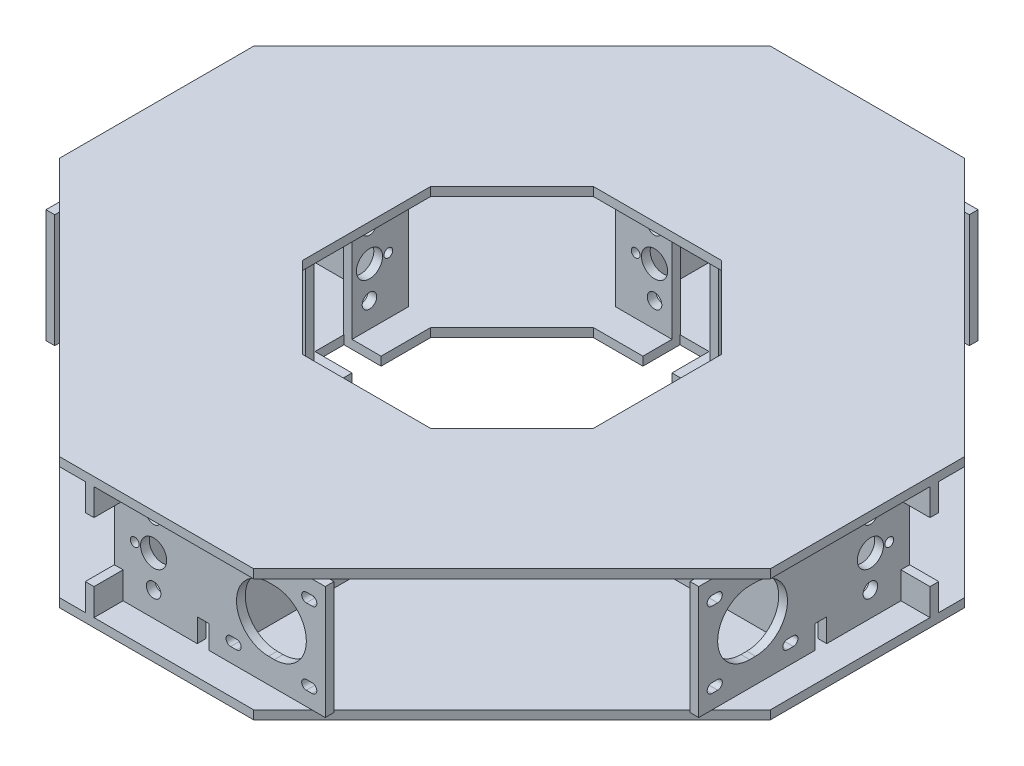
from build123d import *

# Parameters (mm, degrees)
EXTRUDE_1_DEPTH                      = 3
EXTRUDE_START                        = -21.5
SKETCH_2_W                           = 62.2
SKETCH_2_H                           = 75
EXTRUDE_2_DEPTH                      = 3
EXTRUDE_START_2                      = 8
SKETCH_2_2_W                         = 62.2
SKETCH_2_2_H                         = 75
EXTRUDE_3_DEPTH                      = 3
EXTRUDE_4_REACH                      = 190.39
EXTRUDE_4_DIRECTION_2_REACH          = 190.39
EXTRUDE_5_DEPTH                      = 16.5
SKETCH_5_R                           = 4.5
SKETCH_5_R_2                         = 2.5
SKETCH_5_R_3                         = 1.5
CUT_EXTRUDE_1_DEPTH                  = 275.774816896
EXTRUDE_10_DEPTH                     = 3
SKETCH_15_W                          = 6.950303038
SKETCH_15_H                          = 20.520259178
CUT_EXTRUDE_5_DEPTH                  = 10
PATTERN_CIRCULAR_3_COUNT             = 2
PATTERN_CIRCULAR_3_ANGLE             = 90
PATTERN_START                        = -21.5
PATTERN_CIRCULAR_3_COPY_1_SKETCH_W   = 62.2
PATTERN_CIRCULAR_3_COPY_1_SKETCH_H   = 75
PATTERN_CIRCULAR_3_COPY_1_DEPTH      = 3
PATTERN_START_2                      = 8
PATTERN_CIRCULAR_3_COPY_2_SKETCH_W   = 62.2
PATTERN_CIRCULAR_3_COPY_2_SKETCH_H   = 75
PATTERN_CIRCULAR_3_COPY_2_DEPTH      = 3
PATTERN_CIRCULAR_3_COPY_3_REACH      = 190.39
PATTERN_CIRCULAR_3_COPY_4_REACH      = 190.39
PATTERN_CIRCULAR_3_COPY_5_DEPTH      = 16.5
PATTERN_CIRCULAR_3_COPY_6_SKETCH_R   = 4.5
PATTERN_CIRCULAR_3_COPY_6_SKETCH_R_2 = 2.5
PATTERN_CIRCULAR_3_COPY_6_SKETCH_R_3 = 1.5
PATTERN_CIRCULAR_3_COPY_6_DEPTH      = 275.774816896
PATTERN_CIRCULAR_3_COPY_7_DEPTH      = 3
PATTERN_CIRCULAR_3_COPY_8_SKETCH_W   = 6.950303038
PATTERN_CIRCULAR_3_COPY_8_SKETCH_H   = 20.520259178
PATTERN_CIRCULAR_3_COPY_8_DEPTH      = 10
EXTRUDE_START_3                      = 30
EXTRUDE_7_DEPTH                      = 3
EXTRUDE_START_4                      = 72
EXTRUDE_9_DEPTH                      = 3
CUT_EXTRUDE_3_DEPTH                  = 189.389702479
CUT_EXTRUDE_3_DEPTH_BACK             = 189.389702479
SKETCH_8_W                           = 299.042635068
SKETCH_8_H                           = 55.324357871
CUT_EXTRUDE_START                    = 33
SKETCH_13_W                          = 29.351026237
SKETCH_13_H                          = 13.36140494
SKETCH_13_W_2                        = 18.017613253
SKETCH_13_H_2                        = 19.006659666
SKETCH_13_W_3                        = 19.319716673
SKETCH_13_H_3                        = 13.486623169
SKETCH_13_W_4                        = 24.277332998
SKETCH_13_H_4                        = 26.043334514
CUT_EXTRUDE_4_DEPTH                  = 39
EXTRUDE_11_DEPTH                     = 3
EXTRUDE_START_5                      = -45
EXTRUDE_12_DEPTH                     = 3
SKETCH_19_W                          = 25.5
SKETCH_19_H                          = 10
SKETCH_19_W_2                        = 10
SKETCH_19_H_2                        = 25.5
CUT_EXTRUDE_6_DEPTH                  = 3


with BuildPart() as part:
    # Sketch 1 → Extrude 1 (new body)
    with BuildSketch(Plane(origin=(0, 0, 0), x_dir=(1, 0, 0), z_dir=(0, 1, 0))):
        Polygon((-33.363491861, 122.2), (33.363491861, 122.2), (122.2, 33.363491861), (122.2, -33.363491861), (33.363491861, -122.2), (-33.363491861, -122.2), (-122.2, -33.363491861), (-122.2, 33.363491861), align=None)
        Polygon((-12, 60), (12, 60), (60, 12), (60, -12), (12, -60), (-12, -60), (-60, -12), (-60, 12), align=None, mode=Mode.SUBTRACT)
    extrude(amount=-EXTRUDE_1_DEPTH)

    # Sketch 2 → Extrude 2 (add)
    with BuildSketch(Plane.XY.offset(EXTRUDE_START)):
        with Locations((91.1, 37.5)):
            Rectangle(SKETCH_2_W, SKETCH_2_H)
    extrude_2 = extrude(amount=-EXTRUDE_2_DEPTH)

    # Sketch 2_2 → Extrude 3 (add)
    with BuildSketch(Plane.XY.offset(EXTRUDE_START_2)):
        with Locations((91.1, 37.5)):
            Rectangle(SKETCH_2_2_W, SKETCH_2_2_H)
    extrude_3 = extrude(amount=EXTRUDE_3_DEPTH)

    # Sketch 3 → Extrude 4 (add, up to next)
    with BuildSketch(Plane.XY, mode=Mode.PRIVATE) as extrude_4_sk1:
        Polygon((60, 33), (112.2, 33), (112.2, 0), (109.2, 0), (109.2, 30), (60, 30), align=None)
    extrude_4_tool1 = extrude(extrude_4_sk1.sketch, amount=EXTRUDE_4_REACH, mode=Mode.PRIVATE) - part.part
    extrude_4 = extrude_4_tool1.solids().sort_by_distance((86.1, 32.382437, 0))[0]
    add(extrude_4)

    # Sketch 3 → Extrude 4 direction 2 (add, up to next)
    with BuildSketch(Plane.XY, mode=Mode.PRIVATE) as extrude_4_direction_2_sk1:
        Polygon((60, 33), (112.2, 33), (112.2, 0), (109.2, 0), (109.2, 30), (60, 30), align=None)
    extrude_4_direction_2_tool1 = extrude(extrude_4_direction_2_sk1.sketch, amount=-EXTRUDE_4_DIRECTION_2_REACH, mode=Mode.PRIVATE) - part.part
    extrude_4_direction_2 = extrude_4_direction_2_tool1.solids().sort_by_distance((86.1, 32.382437, 0))[0]
    add(extrude_4_direction_2)

    # Sketch 4 → Extrude 5 (add)
    with BuildSketch(Plane.XY.offset(-21.5)):
        Polygon((60, 33), (60, 75), (112.2, 75), (112.2, 33), (109.2, 33), (109.2, 72), (63, 72), (63, 33), align=None)
    extrude_5 = extrude(amount=EXTRUDE_5_DEPTH)

    # Sketch 5 → Cut-Extrude 1 (cut, through all)
    with BuildSketch(Plane(origin=(112.2, 0, 0), x_dir=(0, 0, -1), z_dir=(1, 0, 0))):
        with Locations((11, 52.5)):
            Circle(SKETCH_5_R)
        with Locations((11, 63.5)):
            Circle(SKETCH_5_R_2)
        with Locations((11, 41.5)):
            Circle(SKETCH_5_R_2)
        with Locations((17.5, 52.5)):
            Circle(SKETCH_5_R_3)
    cut_extrude_1 = extrude(amount=-CUT_EXTRUDE_1_DEPTH, mode=Mode.SUBTRACT)

    # Sketch 9 → Extrude 10 (add)
    with BuildSketch(Plane(origin=(112.2, 0, 0), x_dir=(0, 0, -1), z_dir=(1, 0, 0))):
        Polygon((-48, 33), (-8, 33), (-8, 41), (-4, 41), (-4, 33), (5, 33), (5, 72), (-48, 72), align=None)
        with BuildLine():
            Line((-28.5, 41.5), (-30.5, 41.5))
            ThreePointArc((-30.5, 41.5), (-41.5, 52.5), (-30.5, 63.5))
            Line((-30.5, 63.5), (-28.5, 63.5))
            ThreePointArc((-28.5, 63.5), (-17.5, 52.5), (-28.5, 41.5))
        make_face(mode=Mode.SUBTRACT)
        with BuildLine():
            Line((-15.5, 63.9), (-17.5, 63.9))
            ThreePointArc((-17.5, 63.9), (-19.1, 65.5), (-17.5, 67.1))
            Line((-17.5, 67.1), (-15.5, 67.1))
            ThreePointArc((-15.5, 67.1), (-13.9, 65.5), (-15.5, 63.9))
        make_face(mode=Mode.SUBTRACT)
        with BuildLine():
            Line((-41.5, 63.9), (-43.5, 63.9))
            ThreePointArc((-43.5, 63.9), (-45.1, 65.5), (-43.5, 67.1))
            Line((-43.5, 67.1), (-41.5, 67.1))
            ThreePointArc((-41.5, 67.1), (-39.9, 65.5), (-41.5, 63.9))
        make_face(mode=Mode.SUBTRACT)
        with BuildLine():
            Line((-41.5, 37.9), (-43.5, 37.9))
            ThreePointArc((-43.5, 37.9), (-45.1, 39.5), (-43.5, 41.1))
            Line((-43.5, 41.1), (-41.5, 41.1))
            ThreePointArc((-41.5, 41.1), (-39.9, 39.5), (-41.5, 37.9))
        make_face(mode=Mode.SUBTRACT)
        with BuildLine():
            Line((-15.5, 37.9), (-17.5, 37.9))
            ThreePointArc((-17.5, 37.9), (-19.1, 39.5), (-17.5, 41.1))
            Line((-17.5, 41.1), (-15.5, 41.1))
            ThreePointArc((-15.5, 41.1), (-13.9, 39.5), (-15.5, 37.9))
        make_face(mode=Mode.SUBTRACT)
    extrude_10 = extrude(amount=-EXTRUDE_10_DEPTH)

    # Sketch 15 → Cut-Extrude 5 (cut)
    with BuildSketch(Plane(origin=(122.2, 0, 0), x_dir=(0, 0, -1), z_dir=(1, 0, 0))):
        with Locations((24.00036757, 52.5)):
            Rectangle(SKETCH_15_W, SKETCH_15_H)
    cut_extrude_5 = extrude(amount=-CUT_EXTRUDE_5_DEPTH, mode=Mode.SUBTRACT)

    # Mirror 1: Extrude 2, Extrude 3, Extrude 4, Extrude 4 direction 2, Extrude 5, Cut-Extrude 1, Extrude 10, Cut-Extrude 5 across plane
    add(extrude_2.mirror(Plane(origin=(0, 0, 0), x_dir=(0, 0, 1), z_dir=(1, 0, 0))))
    add(extrude_3.mirror(Plane(origin=(0, 0, 0), x_dir=(0, 0, 1), z_dir=(1, 0, 0))))
    add(extrude_4.mirror(Plane(origin=(0, 0, 0), x_dir=(0, 0, 1), z_dir=(1, 0, 0))))
    add(extrude_4_direction_2.mirror(Plane(origin=(0, 0, 0), x_dir=(0, 0, 1), z_dir=(1, 0, 0))))
    add(extrude_5.mirror(Plane(origin=(0, 0, 0), x_dir=(0, 0, 1), z_dir=(1, 0, 0))))
    add(cut_extrude_1.mirror(Plane(origin=(0, 0, 0), x_dir=(0, 0, 1), z_dir=(1, 0, 0))), mode=Mode.SUBTRACT)
    add(extrude_10.mirror(Plane(origin=(0, 0, 0), x_dir=(0, 0, 1), z_dir=(1, 0, 0))))
    add(cut_extrude_5.mirror(Plane(origin=(0, 0, 0), x_dir=(0, 0, 1), z_dir=(1, 0, 0))), mode=Mode.SUBTRACT)

    # Pattern Circular 3: Extrude 2, Extrude 3, Extrude 4, Extrude 4 direction 2, Extrude 5, Cut-Extrude 1, Extrude 10, Cut-Extrude 5 ×2 about axis
    pattern_circular_3_axis = Axis((0, 0, 0), (0, 1, 0))
    add([extrude_2.rotate(pattern_circular_3_axis, i * PATTERN_CIRCULAR_3_ANGLE / (PATTERN_CIRCULAR_3_COUNT - 1)) for i in range(1, PATTERN_CIRCULAR_3_COUNT)])
    add([extrude_3.rotate(pattern_circular_3_axis, i * PATTERN_CIRCULAR_3_ANGLE / (PATTERN_CIRCULAR_3_COUNT - 1)) for i in range(1, PATTERN_CIRCULAR_3_COUNT)])
    add([extrude_4.rotate(pattern_circular_3_axis, i * PATTERN_CIRCULAR_3_ANGLE / (PATTERN_CIRCULAR_3_COUNT - 1)) for i in range(1, PATTERN_CIRCULAR_3_COUNT)])
    add([extrude_4_direction_2.rotate(pattern_circular_3_axis, i * PATTERN_CIRCULAR_3_ANGLE / (PATTERN_CIRCULAR_3_COUNT - 1)) for i in range(1, PATTERN_CIRCULAR_3_COUNT)])
    add([extrude_5.rotate(pattern_circular_3_axis, i * PATTERN_CIRCULAR_3_ANGLE / (PATTERN_CIRCULAR_3_COUNT - 1)) for i in range(1, PATTERN_CIRCULAR_3_COUNT)])
    add([cut_extrude_1.rotate(pattern_circular_3_axis, i * PATTERN_CIRCULAR_3_ANGLE / (PATTERN_CIRCULAR_3_COUNT - 1)) for i in range(1, PATTERN_CIRCULAR_3_COUNT)], mode=Mode.SUBTRACT)
    add([extrude_10.rotate(pattern_circular_3_axis, i * PATTERN_CIRCULAR_3_ANGLE / (PATTERN_CIRCULAR_3_COUNT - 1)) for i in range(1, PATTERN_CIRCULAR_3_COUNT)])
    add([cut_extrude_5.rotate(pattern_circular_3_axis, i * PATTERN_CIRCULAR_3_ANGLE / (PATTERN_CIRCULAR_3_COUNT - 1)) for i in range(1, PATTERN_CIRCULAR_3_COUNT)], mode=Mode.SUBTRACT)

    # Pattern Circular 3 copy 1 sketch → Pattern Circular 3 copy 1 (add)
    with BuildSketch(Plane(origin=(0, 0, 0), x_dir=(0, 0, 1), z_dir=(1, 0, 0)).offset(PATTERN_START)):
        with Locations((91.1, -37.5)):
            Rectangle(PATTERN_CIRCULAR_3_COPY_1_SKETCH_W, PATTERN_CIRCULAR_3_COPY_1_SKETCH_H)
    extrude(amount=-PATTERN_CIRCULAR_3_COPY_1_DEPTH)

    # Pattern Circular 3 copy 2 sketch → Pattern Circular 3 copy 2 (add)
    with BuildSketch(Plane(origin=(0, 0, 0), x_dir=(0, 0, 1), z_dir=(1, 0, 0)).offset(PATTERN_START_2)):
        with Locations((91.1, -37.5)):
            Rectangle(PATTERN_CIRCULAR_3_COPY_2_SKETCH_W, PATTERN_CIRCULAR_3_COPY_2_SKETCH_H)
    extrude(amount=PATTERN_CIRCULAR_3_COPY_2_DEPTH)

    # Pattern Circular 3 copy 3 sketch → Pattern Circular 3 copy 3 (add, up to next)
    with BuildSketch(Plane(origin=(0, 0, 0), x_dir=(0, 0, 1), z_dir=(1, 0, 0)), mode=Mode.PRIVATE) as pattern_circular_3_copy_3_sk1:
        Polygon((60, -33), (112.2, -33), (112.2, 0), (109.2, 0), (109.2, -30), (60, -30), align=None)
    pattern_circular_3_copy_3_tool1 = extrude(pattern_circular_3_copy_3_sk1.sketch, amount=PATTERN_CIRCULAR_3_COPY_3_REACH, mode=Mode.PRIVATE) - part.part
    add(pattern_circular_3_copy_3_tool1.solids().sort_by_distance((0, 32.382437, 86.1))[0])

    # Pattern Circular 3 copy 4 sketch → Pattern Circular 3 copy 4 (add, up to next)
    with BuildSketch(Plane(origin=(0, 0, 0), x_dir=(0, 0, 1), z_dir=(1, 0, 0)), mode=Mode.PRIVATE) as pattern_circular_3_copy_4_sk1:
        Polygon((60, -33), (112.2, -33), (112.2, 0), (109.2, 0), (109.2, -30), (60, -30), align=None)
    pattern_circular_3_copy_4_tool1 = extrude(pattern_circular_3_copy_4_sk1.sketch, amount=-PATTERN_CIRCULAR_3_COPY_4_REACH, mode=Mode.PRIVATE) - part.part
    add(pattern_circular_3_copy_4_tool1.solids().sort_by_distance((0, 32.382437, 86.1))[0])

    # Pattern Circular 3 copy 5 sketch → Pattern Circular 3 copy 5 (add)
    with BuildSketch(Plane(origin=(-21.5, 0, 0), x_dir=(0, 0, 1), z_dir=(1, 0, 0))):
        Polygon((60, -33), (60, -75), (112.2, -75), (112.2, -33), (109.2, -33), (109.2, -72), (63, -72), (63, -33), align=None)
    extrude(amount=PATTERN_CIRCULAR_3_COPY_5_DEPTH)

    # Pattern Circular 3 copy 6 sketch → Pattern Circular 3 copy 6 (cut, through all)
    with BuildSketch(Plane(origin=(0, 0, 112.2), x_dir=(-1, 0, 0), z_dir=(0, 0, 1))):
        with Locations((11, -52.5)):
            Circle(PATTERN_CIRCULAR_3_COPY_6_SKETCH_R)
        with Locations((11, -63.5)):
            Circle(PATTERN_CIRCULAR_3_COPY_6_SKETCH_R_2)
        with Locations((11, -41.5)):
            Circle(PATTERN_CIRCULAR_3_COPY_6_SKETCH_R_2)
        with Locations((17.5, -52.5)):
            Circle(PATTERN_CIRCULAR_3_COPY_6_SKETCH_R_3)
    extrude(amount=-PATTERN_CIRCULAR_3_COPY_6_DEPTH, mode=Mode.SUBTRACT)

    # Pattern Circular 3 copy 7 sketch → Pattern Circular 3 copy 7 (add)
    with BuildSketch(Plane(origin=(0, 0, 112.2), x_dir=(-1, 0, 0), z_dir=(0, 0, 1))):
        Polygon((-48, -33), (-8, -33), (-8, -41), (-4, -41), (-4, -33), (5, -33), (5, -72), (-48, -72), align=None)
        with BuildLine():
            Line((-28.5, -41.5), (-30.5, -41.5))
            ThreePointArc((-30.5, -41.5), (-41.5, -52.5), (-30.5, -63.5))
            Line((-30.5, -63.5), (-28.5, -63.5))
            ThreePointArc((-28.5, -63.5), (-17.5, -52.5), (-28.5, -41.5))
        make_face(mode=Mode.SUBTRACT)
        with BuildLine():
            Line((-15.5, -63.9), (-17.5, -63.9))
            ThreePointArc((-17.5, -63.9), (-19.1, -65.5), (-17.5, -67.1))
            Line((-17.5, -67.1), (-15.5, -67.1))
            ThreePointArc((-15.5, -67.1), (-13.9, -65.5), (-15.5, -63.9))
        make_face(mode=Mode.SUBTRACT)
        with BuildLine():
            Line((-41.5, -63.9), (-43.5, -63.9))
            ThreePointArc((-43.5, -63.9), (-45.1, -65.5), (-43.5, -67.1))
            Line((-43.5, -67.1), (-41.5, -67.1))
            ThreePointArc((-41.5, -67.1), (-39.9, -65.5), (-41.5, -63.9))
        make_face(mode=Mode.SUBTRACT)
        with BuildLine():
            Line((-41.5, -37.9), (-43.5, -37.9))
            ThreePointArc((-43.5, -37.9), (-45.1, -39.5), (-43.5, -41.1))
            Line((-43.5, -41.1), (-41.5, -41.1))
            ThreePointArc((-41.5, -41.1), (-39.9, -39.5), (-41.5, -37.9))
        make_face(mode=Mode.SUBTRACT)
        with BuildLine():
            Line((-15.5, -37.9), (-17.5, -37.9))
            ThreePointArc((-17.5, -37.9), (-19.1, -39.5), (-17.5, -41.1))
            Line((-17.5, -41.1), (-15.5, -41.1))
            ThreePointArc((-15.5, -41.1), (-13.9, -39.5), (-15.5, -37.9))
        make_face(mode=Mode.SUBTRACT)
    extrude(amount=-PATTERN_CIRCULAR_3_COPY_7_DEPTH)

    # Pattern Circular 3 copy 8 sketch → Pattern Circular 3 copy 8 (cut)
    with BuildSketch(Plane(origin=(0, 0, 122.2), x_dir=(-1, 0, 0), z_dir=(0, 0, 1))):
        with Locations((24.00036757, -52.5)):
            Rectangle(PATTERN_CIRCULAR_3_COPY_8_SKETCH_W, PATTERN_CIRCULAR_3_COPY_8_SKETCH_H)
    extrude(amount=-PATTERN_CIRCULAR_3_COPY_8_DEPTH, mode=Mode.SUBTRACT)

    # Sketch 1_2 → Extrude 7 (add)
    with BuildSketch(Plane(origin=(0, 0, 0), x_dir=(1, 0, 0), z_dir=(0, 1, 0)).offset(EXTRUDE_START_3)):
        Polygon((-33.363491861, 122.2), (33.363491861, 122.2), (122.2, 33.363491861), (122.2, -33.363491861), (33.363491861, -122.2), (-33.363491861, -122.2), (-122.2, -33.363491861), (-122.2, 33.363491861), align=None)
        Polygon((-12, 60), (12, 60), (60, 12), (60, -12), (12, -60), (-12, -60), (-60, -12), (-60, 12), align=None, mode=Mode.SUBTRACT)
    extrude(amount=EXTRUDE_7_DEPTH)

    # Sketch 1_3 → Extrude 9 (add)
    with BuildSketch(Plane(origin=(0, 0, 0), x_dir=(1, 0, 0), z_dir=(0, 1, 0)).offset(EXTRUDE_START_4)):
        Polygon((-33.363491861, 122.2), (33.363491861, 122.2), (122.2, 33.363491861), (122.2, -33.363491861), (33.363491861, -122.2), (-33.363491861, -122.2), (-122.2, -33.363491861), (-122.2, 33.363491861), align=None)
        Polygon((-12, 60), (12, 60), (60, 12), (60, -12), (12, -60), (-12, -60), (-60, -12), (-60, 12), align=None, mode=Mode.SUBTRACT)
    extrude(amount=EXTRUDE_9_DEPTH)

    # Sketch 8 → Cut-Extrude 3 (cut, two sides: drawn at the far end of the back side and taken through both)
    with BuildSketch(Plane.XY.offset(-CUT_EXTRUDE_3_DEPTH_BACK)):
        with Locations((2.551074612, 2.337821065)):
            Rectangle(SKETCH_8_W, SKETCH_8_H)
    extrude(amount=CUT_EXTRUDE_3_DEPTH + CUT_EXTRUDE_3_DEPTH_BACK, mode=Mode.SUBTRACT)

    # Sketch 13 → Cut-Extrude 4 (cut)
    with BuildSketch(Plane(origin=(0, 0, 0), x_dir=(1, 0, 0), z_dir=(0, 1, 0)).offset(CUT_EXTRUDE_START)):
        with Locations((6.175513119, 118.88070247)):
            Rectangle(SKETCH_13_W, SKETCH_13_H)
        with Locations((121.208806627, -13.286909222)):
            Rectangle(SKETCH_13_W_2, SKETCH_13_H_2)
        with Locations((9.659858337, -118.943311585)):
            Rectangle(SKETCH_13_W_3, SKETCH_13_H_3)
        with Locations((-124.338666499, -9.768571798)):
            Rectangle(SKETCH_13_W_4, SKETCH_13_H_4)
    extrude(amount=CUT_EXTRUDE_4_DEPTH, mode=Mode.SUBTRACT)

    # Sketch 18 → Extrude 11 (add)
    with BuildSketch(Plane.XZ.offset(-30)):
        Polygon((60, 12), (50, 22), (50, -22), (60, -12), align=None)
        Polygon((12, -60), (22, -50), (-22, -50), (-12, -60), align=None)
        Polygon((-60, -12), (-50, -22), (-50, 22), (-60, 12), align=None)
        Polygon((-12, 60), (-22, 50), (22, 50), (12, 60), align=None)
    extrude(amount=-EXTRUDE_11_DEPTH)

    # Sketch 18_2 → Extrude 12 (add)
    with BuildSketch(Plane.XZ.offset(-30).offset(EXTRUDE_START_5)):
        Polygon((60, 12), (50, 22), (50, -22), (60, -12), align=None)
        Polygon((12, -60), (22, -50), (-22, -50), (-12, -60), align=None)
        Polygon((-60, -12), (-50, -22), (-50, 22), (-60, 12), align=None)
        Polygon((-12, 60), (-22, 50), (22, 50), (12, 60), align=None)
    extrude(amount=EXTRUDE_12_DEPTH)

    # Sketch 19 → Cut-Extrude 6 (cut)
    with BuildSketch(Plane.XZ.offset(-30)):
        with Locations((50, 0)):
            Rectangle(SKETCH_19_W, SKETCH_19_H)
        with Locations((0, 50)):
            Rectangle(SKETCH_19_W_2, SKETCH_19_H_2)
        with Locations((0, -50)):
            Rectangle(SKETCH_19_W_2, SKETCH_19_H_2)
        with Locations((-50, 0)):
            Rectangle(SKETCH_19_W, SKETCH_19_H)
    extrude(amount=-CUT_EXTRUDE_6_DEPTH, mode=Mode.SUBTRACT)


solid = part.part
